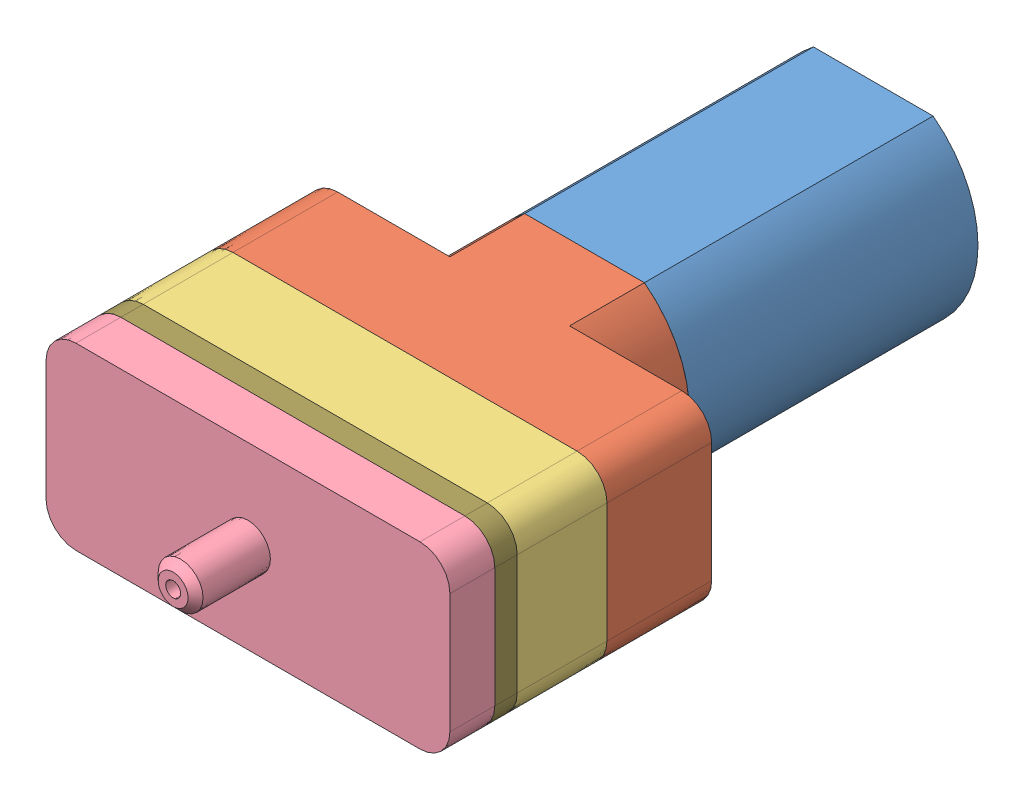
SolidWorks assembly compresseur.SLDASM, configuration Défaut (file format 4400). Lengths in mm.
Overall size (27 12 46.8).
17 component instances, 15 part files, 33 mates.
Components (placement in the parent):
- moteur-1: moteur.SLDPRT [Défaut] at origin size (14 12 19.3)
- carter1-1: carter1.SLDPRT [Défaut] at (0 0 19.3) size (27 12 12)
- carter3-1: carter3.SLDPRT [Défaut] at (0 0 37.3) size (27 12 6)
- carter2-1: carter2.SLDPRT [Défaut] at (0 0 38.8) size (27 12 8)
- axe large-2: axe large.SLDPRT [Défaut] at (0 0 17.3) size (1.5 1.5 5)
- excentrique-1: excentrique.sldprt [Défaut] at (0 0 26.9) x (0 0 1) z (0 1 0) size (5.6 8.4 8.4)
- axe fin-1: axe fin.SLDPRT [Défaut] at (-2.8013 0 21.657) x (0.612748 0.776466 -0.147108) z (0.233445 0 0.97237) size (1 1 10)
- plateau-1: plateau.sldprt [Défaut] at (0 0 33.3255) x (0 1 0) z (-0.233445 0 -0.97237) size (4 13.61 4)
- piston-1: piston.SLDPRT [Défaut] at (6 0 30.3639) size (1.5 1.5 4.75) (hidden)
- membrane-1: membrane.SLDPRT [Défaut] at (4.7483 0 29.4773) x (0.180452 0 0.983584) z (-0.983486 0.014104 0.180434) size (8.59 7 7)
- piston-2: piston.SLDPRT [Défaut] at (-6 0 33.421) x (-0.936013 -0.351964 0) z (0 0 1) size (1.5 1.5 4.75) (hidden)
- membrane2-1: membrane2.SLDPRT [Défaut] at (-5.8889 0 32.0407) x (-0.026067 0 0.99966) z (-0.999645 0.005527 -0.026066) size (5.38 7 7)
- carter4-1: carter4.SLDPRT [Défaut] at (0 0 38.8) x (-1 0 0) z (0 0 -1) size (27 12 2.5)
- joint-1: joint.SLDPRT [Défaut] at (0 0 36.3) size (25 10 1)
- clapet-1: clapet.SLDPRT [Défaut] at (0 0 38.8) x (0 1 0) z (0 0 1) size (6 6 2)
- clapet2-1: clapet2.SLDPRT [Défaut] at (-6 0 37.3) size (5 5 2.89)
- clapet2-2: clapet2.SLDPRT [Défaut] at (6 0 37.3) size (5 5 2.89)
Mates (geometry in assembly coordinates):
- Coïncidente1: coincident anti-aligned: plane of moteur-1 through (-0.5 0 19.3) normal (0 0 1); plane of carter1-1 through (-0.5 0 19.3) normal (0 0 -1)
- Coïncidente2: coincident aligned: circle of moteur-1; circle of carter1-1
- Coïncidente3: coincident anti-aligned: plane of carter1-1 through (-11.5 4 31.3) normal (0 0 1); plane of carter3-1 through (-11.5 -4 31.3) normal (0 0 -1)
- Coïncidente4: coincident aligned: circle of carter1-1; circle of carter3-1
- Coaxiale1: concentric anti-aligned: cylinder of moteur-1 through (0 0 17.3) axis (0 0 1) radius 0.75; cylinder of axe large-2 through (0 0 22.3) axis (0 0 -1) radius 0.75
- Coïncidente7: coincident anti-aligned: plane of moteur-1 through (0 0 17.3) normal (0 0 1); plane of axe large-2 through (0 0 17.3) normal (0 0 -1)
- Distance1: distance = 2 mm anti-aligned: plane of excentrique-1 through (-4.2 0 21.3) normal (0 0 -1); plane of moteur-1 through (-0.5 0 19.3) normal (0 0 1)
- Coaxiale3: concentric aligned: cylinder of axe large-2 through (0 0 22.3) axis (0 0 -1) radius 0.75; cylinder of excentrique-1 through (0 0 25.4) axis (0 0 -1) radius 0.75
- Coaxiale5: concentric anti-aligned: cylinder of excentrique-1 through (-2.6491 0 22.2911) axis (0.233445 0 0.97237) radius 0.5; cylinder of axe fin-1 through (-0.4669 0 31.3807) axis (-0.233445 0 -0.97237) radius 0.5
- Coaxiale6: concentric anti-aligned: cylinder of axe fin-1 through (-0.4669 0 31.3807) axis (-0.233445 0 -0.97237) radius 0.5; cylinder of plateau-1 through (0 0 33.3255) axis (0.233445 0 0.97237) radius 0.5
- Coïncidente9: coincident anti-aligned: plane of axe fin-1 through (-0.4669 0 31.3807) normal (0.233445 0 0.97237); plane of plateau-1 through (-0.4669 0 31.3807) normal (-0.233445 0 -0.97237)
- Coïncidente12: coincident: line of axe large-2 through (0 0 22.3) axis (0 0 -1); moEndPointRef_w of plateau-1
- Coaxiale7: concentric aligned: cylinder of carter3-1 through (6 0 37.3) axis (0 0 -1) radius 4.5; cylinder of piston-1 through (6 0 34.3639) axis (0 0 -1) radius 0.5
- Coïncidente13: coincident: line of plateau-1 through (6.237 0 30.1476) axis (-0.891007 0 0.45399); point of piston-1
- Parallèle1: parallel aligned: cylinder of membrane-1 through (4.6434 0 28.9058) axis (-0.180452 0 -0.983584) radius 0.5; line of assembly
- Coïncidente18: coincident: point of membrane-1; point of plateau-1
- Coaxiale8: concentric aligned: cylinder of carter3-1 through (-6 0 37.3) axis (0 0 -1) radius 4.5; cylinder of piston-2 through (-6 0 37.421) axis (0 0 -1) radius 0.5
- Coïncidente21: coincident: plane of plateau-1 through (-7 -2 33.3255) normal (0 0 1); point of piston-2
- Parallèle6: parallel anti-aligned: cylinder of membrane2-1 through (-5.8738 0 31.4598) axis (0.026067 0 -0.99966) radius 0.5; line of assembly
- Coïncidente26: coincident: point of membrane2-1; point of plateau-1
- Coïncidente29: coincident anti-aligned: line of carter3-1 through (11.5 6 37.3) axis (-1 0 0); line of carter4-1 through (-11.5 6 37.3) axis (1 0 0)
- Coïncidente30: coincident anti-aligned: line of carter3-1 through (13.5 -4 37.3) axis (0 1 0); line of carter4-1 through (13.5 4 37.3) axis (0 -1 0)
- Coïncidente31: coincident anti-aligned: line of carter2-1 through (13.5 -4 38.8) axis (0 1 0); line of carter4-1 through (13.5 4 38.8) axis (0 -1 0)
- Coïncidente32: coincident anti-aligned: line of carter2-1 through (11.5 6 38.8) axis (-1 0 0); line of carter4-1 through (-11.5 6 38.8) axis (1 0 0)
- Coïncidente35: coincident aligned: line of carter3-1 through (11.5 5 36.3) axis (-1 0 0); line of joint-1 through (11.5 5 36.3) axis (-1 0 0)
- Coïncidente36: coincident aligned: line of carter3-1 through (12.5 -4 36.3) axis (0 1 0); line of joint-1 through (12.5 -4 36.3) axis (0 1 0)
- Coïncidente38: coincident anti-aligned: circle of carter4-1; circle of clapet-1
- Coaxiale9: concentric aligned: cylinder of carter4-1 through (0 -1.5 37.3) axis (0 0 1) radius 0.5; circle of clapet-1
- Coaxiale10: concentric aligned: cylinder of carter4-1 through (-6 0 37.3) axis (0 0 1) radius 0.5; cylinder of clapet2-1 through (-6 0 40.9754) axis (0 0 1) radius 0.5
- Coïncidente40: coincident anti-aligned: plane of carter4-1 through (11.5 -4 37.3) normal (0 0 -1); plane of clapet2-1 through (-6 0.5 37.3) normal (0 0 1)
- Coaxiale11: concentric aligned: cylinder of carter4-1 through (6 0 37.3) axis (0 0 1) radius 0.5; cylinder of clapet2-2 through (6 0 40.9754) axis (0 0 1) radius 0.5
- Coïncidente41: coincident anti-aligned: plane of carter4-1 through (11.5 -4 37.3) normal (0 0 -1); plane of clapet2-2 through (6 0.5 37.3) normal (0 0 1)
- Axe2: unknown = 30 mm: unknown of joint-1; unknown of membrane-1
